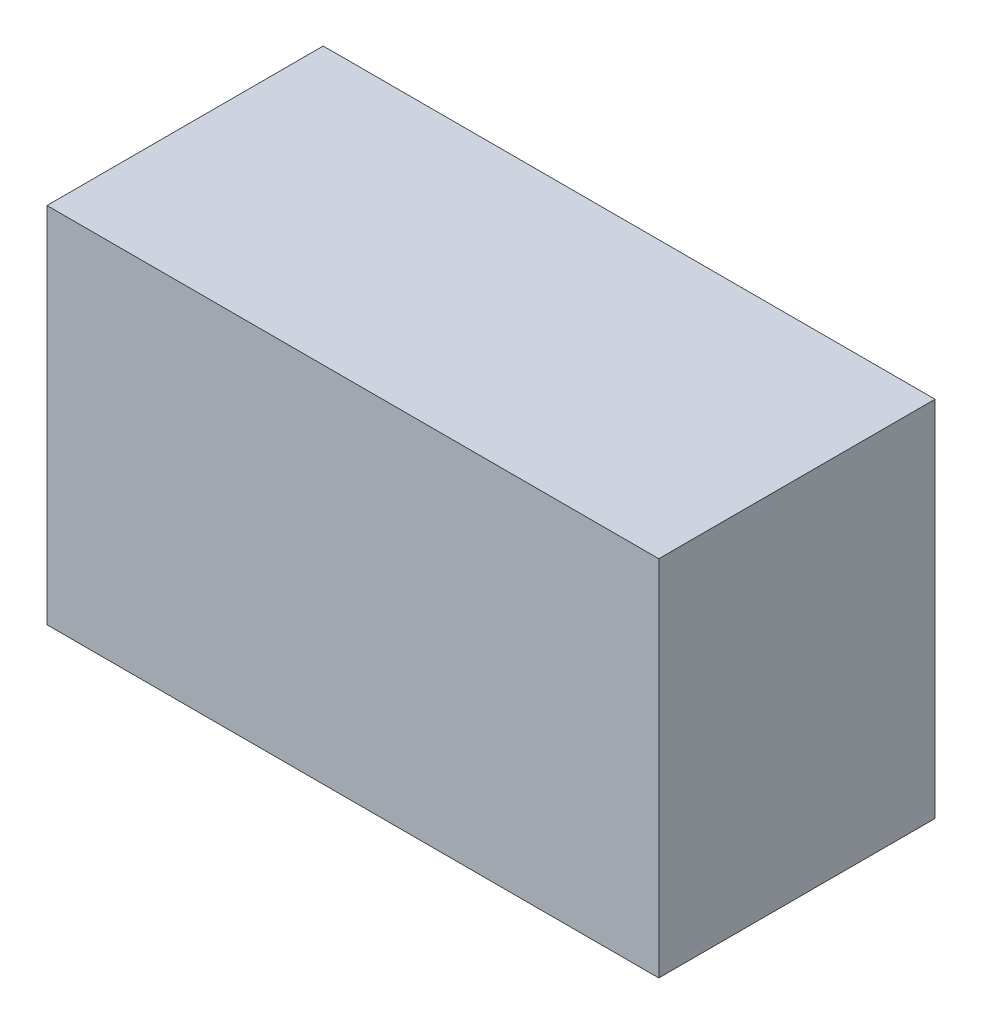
from build123d import *

# Parameters (mm, degrees)
SKETCH1_W      = 75.942994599
SKETCH1_H      = 45.071858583
EXTRUDE1_DEPTH = 34.29


with BuildPart() as part:
    # Sketch1 → Extrude1 (new body)
    with BuildSketch(Plane.XY):
        with Locations((1.389201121, -5.093737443)):
            Rectangle(SKETCH1_W, SKETCH1_H)
    extrude(amount=EXTRUDE1_DEPTH)


solid = part.part
